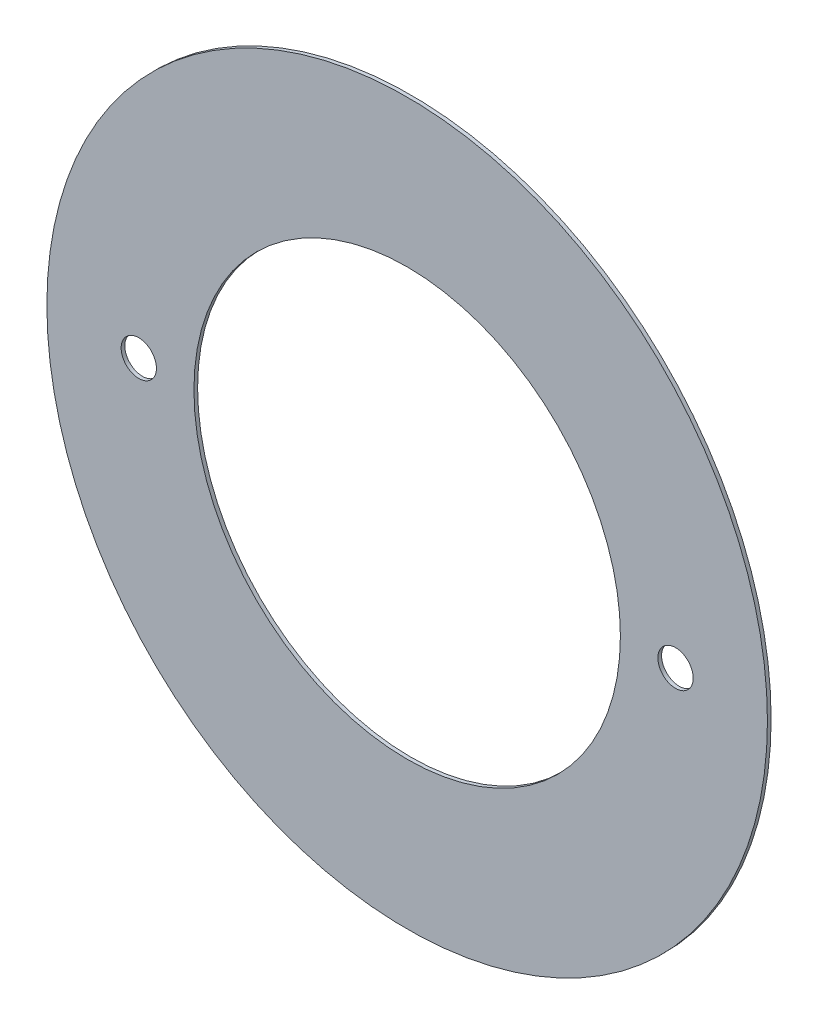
from build123d import *

# Parameters (mm, degrees)
ESQUISSE1_R      = 49
ESQUISSE1_R_2    = 29
ESQUISSE1_R_3    = 2.4
EXTRUSION1_DEPTH = 0.5


with BuildPart() as part:
    # Esquisse1 → Extrusion1 (new body)
    with BuildSketch(Plane.XY):
        Circle(ESQUISSE1_R)
        Circle(ESQUISSE1_R_2, mode=Mode.SUBTRACT)
        with Locations((36.5, 0)):
            Circle(ESQUISSE1_R_3, mode=Mode.SUBTRACT)
        with Locations((-36.5, 0)):
            Circle(ESQUISSE1_R_3, mode=Mode.SUBTRACT)
    extrude(amount=EXTRUSION1_DEPTH)


solid = part.part
